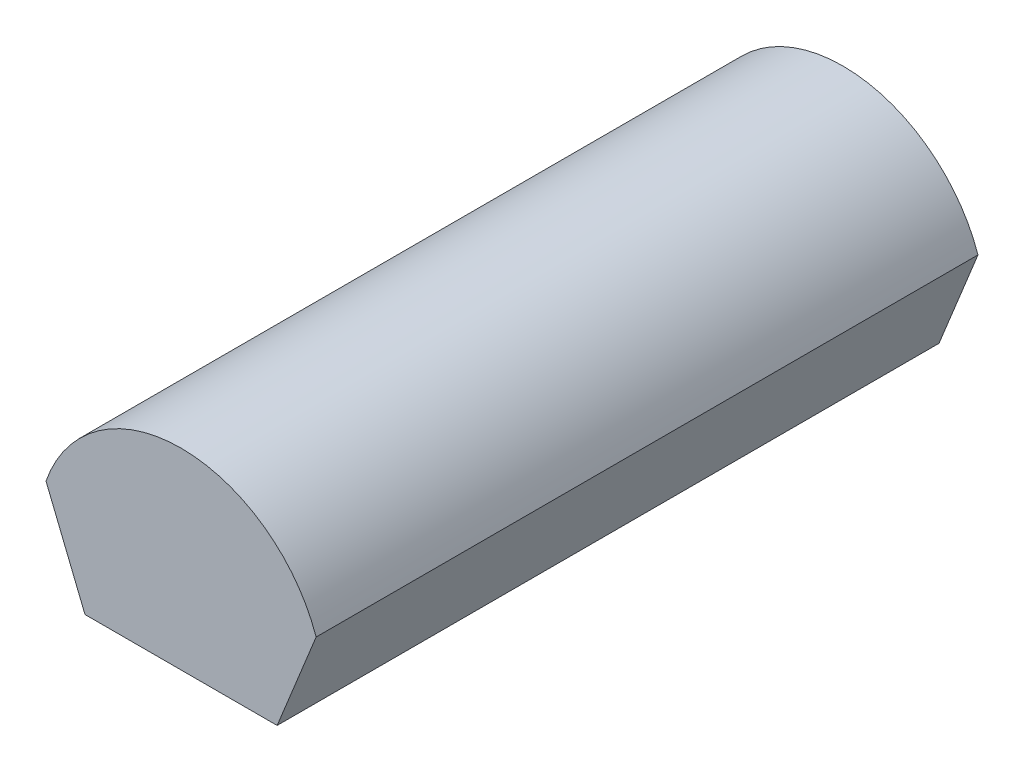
from build123d import *

# Parameters (mm, degrees)
SALIENTE_EXTRUIR1_DEPTH      = 155
SALIENTE_EXTRUIR1_DEPTH_BACK = 155


with BuildPart() as part:
    # Croquis1 → Saliente-Extruir1 (new, two sides: drawn at the far end of the back side and taken through both)
    with BuildSketch(Plane.XY.offset(-SALIENTE_EXTRUIR1_DEPTH_BACK)):
        with BuildLine():
            Line((-45, 0), (45, 0))
            Line((45, 0), (63.25969941, 45))
            ThreePointArc((63.25969941, 45), (0, 90), (-63.25969941, 45))
            Line((-63.25969941, 45), (-45, 0))
        make_face()
    extrude(amount=SALIENTE_EXTRUIR1_DEPTH + SALIENTE_EXTRUIR1_DEPTH_BACK)


solid = part.part
